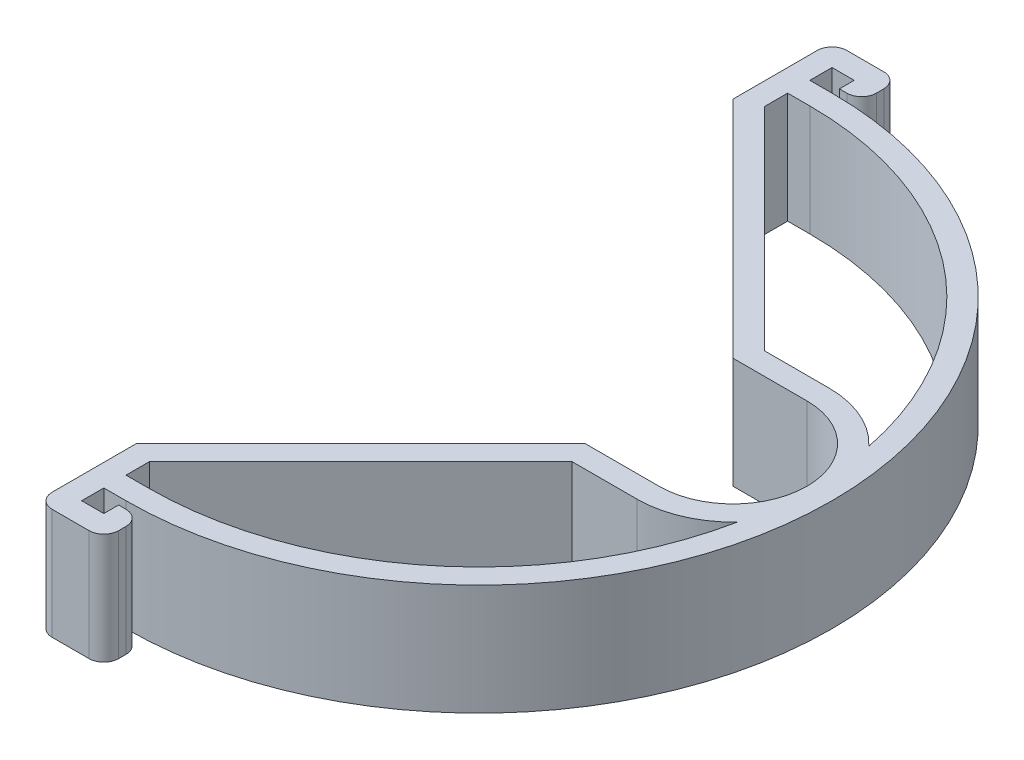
from build123d import *

# Parameters (mm, degrees)
BOSS_EXTRUDE1_DEPTH = 15


with BuildPart() as part:
    # Sketch1 → Boss-Extrude1 (new body)
    with BuildSketch(Plane(origin=(0, 0, 0), x_dir=(1, 0, 0), z_dir=(0, 1, 0))):
        with BuildLine():
            Line((-6, 40.360650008), (0, 34.360650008))
            Line((0, 34.360650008), (24.360650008, 10))
            Line((24.360650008, 10), (34.360650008, 10))
            ThreePointArc((34.360650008, 10), (44.360650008, 0), (34.360650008, -10))
            Line((34.360650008, -10), (24.360650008, -10))
            Line((24.360650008, -10), (0, -34.360650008))
            Line((0, -34.360650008), (-6, -40.360650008))
            Line((-6, -40.360650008), (-6, -51.75))
            ThreePointArc((-6, -51.75), (-5.414213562, -53.164213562), (-4, -53.75))
            Line((-4, -53.75), (1, -53.75))
            ThreePointArc((1, -53.75), (2.414213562, -53.164213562), (3, -51.75))
            Line((3, -51.75), (3, -50.75))
            ThreePointArc((3, -50.75), (2.414213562, -49.335786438), (1, -48.75))
            Line((1, -48.75), (0, -48.75))
            Line((0, -48.75), (0, -50.75))
            Line((0, -50.75), (-3, -50.75))
            Line((-3, -50.75), (-3, -47.75))
            Line((-3, -47.75), (0, -47.75))
            ThreePointArc((0, -47.75), (47.75, 0), (0, 47.75))
            Line((0, 47.75), (-3, 47.75))
            Line((-3, 47.75), (-3, 50.75))
            Line((-3, 50.75), (0, 50.75))
            Line((0, 50.75), (0, 48.75))
            Line((0, 48.75), (1, 48.75))
            ThreePointArc((1, 48.75), (2.414213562, 49.335786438), (3, 50.75))
            Line((3, 50.75), (3, 51.75))
            ThreePointArc((3, 51.75), (2.414213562, 53.164213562), (1, 53.75))
            Line((1, 53.75), (-4, 53.75))
            ThreePointArc((-4, 53.75), (-5.414213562, 53.164213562), (-6, 51.75))
            Line((-6, 51.75), (-6, 40.360650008))
        make_face()
        with BuildLine():
            Line((2.121320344, -36.481970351), (25.603290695, -13))
            Line((25.603290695, -13), (34.360650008, -13))
            ThreePointArc((34.360650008, -13), (39.539827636, -11.923762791), (43.86146316, -8.873249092))
            ThreePointArc((43.86146316, -8.873249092), (28.332707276, -34.638420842), (0, -44.75))
            Line((0, -44.75), (-3, -44.75))
            Line((-3, -44.75), (-3, -41.603290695))
            Line((-3, -41.603290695), (2.121320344, -36.481970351))
        make_face(mode=Mode.SUBTRACT)
        with BuildLine():
            Line((-3, 44.75), (0, 44.75))
            ThreePointArc((0, 44.75), (28.332707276, 34.638420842), (43.86146316, 8.873249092))
            ThreePointArc((43.86146316, 8.873249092), (39.539827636, 11.923762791), (34.360650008, 13))
            Line((34.360650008, 13), (25.603290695, 13))
            Line((25.603290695, 13), (2.121320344, 36.481970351))
            Line((2.121320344, 36.481970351), (-3, 41.603290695))
            Line((-3, 41.603290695), (-3, 44.75))
        make_face(mode=Mode.SUBTRACT)
    extrude(amount=BOSS_EXTRUDE1_DEPTH)


solid = part.part
